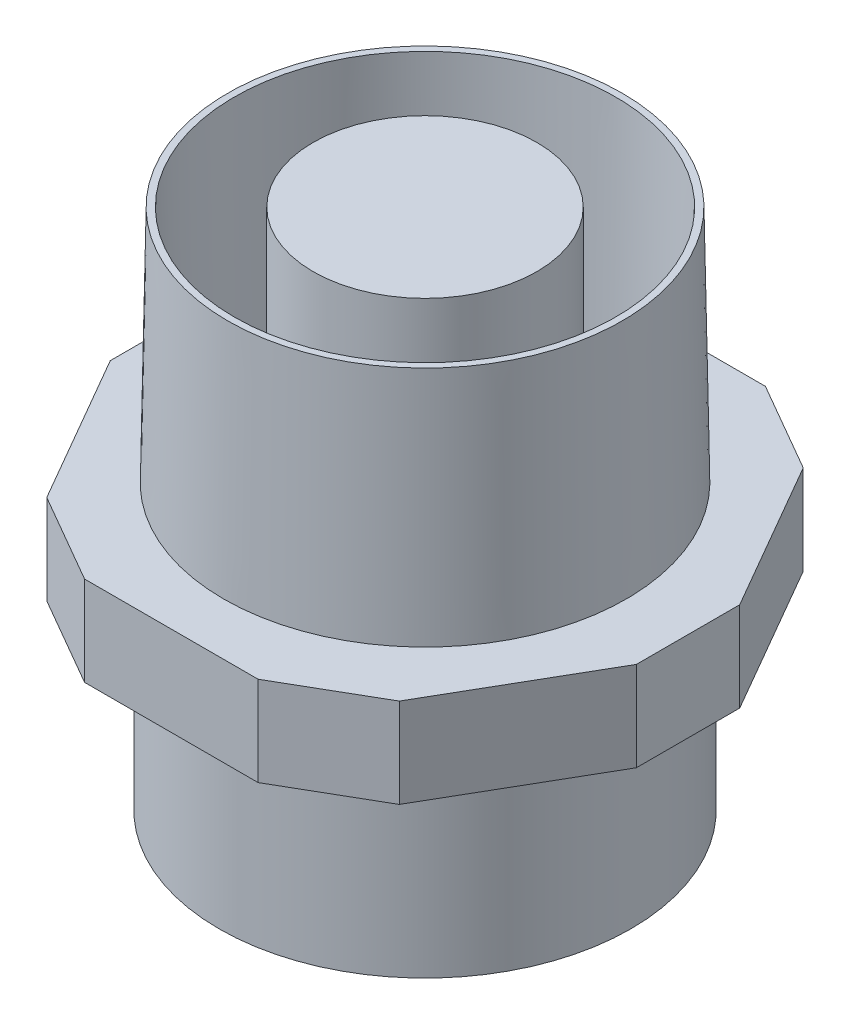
from build123d import *

# Parameters (mm, degrees)
EXTRUSION1_DEPTH = 3
ESQUISSE2_R      = 6.75
ESQUISSE2_R_2    = 6.25
EXTRUSION2_DEPTH = 8
EXTRUSION2_DRAFT = 1
ESQUISSE3_R      = 6.9
EXTRUSION3_DEPTH = 6.5
CHANFREIN1_SIZE  = 2
ESQUISSE4_R      = 3.75
EXTRUSION4_DEPTH = 8


with BuildPart() as part:
    # Esquisse1 → Extrusion1 (new body)
    with BuildSketch(Plane(origin=(0, 0, 0), x_dir=(1, 0, 0), z_dir=(0, 1, 0))):
        Polygon((9.814954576, 0), (4.907477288, 8.5), (-4.907477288, 8.5), (-9.814954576, 0), (-4.907477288, -8.5), (4.907477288, -8.5), align=None)
    extrude(amount=EXTRUSION1_DEPTH)


with BuildPart() as extrusion2_tool:
    # Esquisse2 → Extrusion2 (with draft: the straight prism first)
    with BuildSketch(Plane(origin=(0, 3, 0), x_dir=(1, 0, 0), z_dir=(0, 1, 0))):
        Circle(ESQUISSE2_R)
        Circle(ESQUISSE2_R_2, mode=Mode.SUBTRACT)
    extrude(amount=EXTRUSION2_DEPTH)
    # Extrusion2: the draft: its side faces are tilted about the plane it starts from
    extrusion2_sides = [extrusion2_tool.faces().sort_by_distance(p)[0] for p in [
        (-6.75, 7, 0),
        (-6.25, 7, 0),
    ]]
    draft(extrusion2_sides, Plane(origin=(0, 3, 0), x_dir=(1, 0, 0), z_dir=(0, 1, 0)), EXTRUSION2_DRAFT)


with BuildPart() as part_1:
    add(part.part)

    # Extrusion2: add extrusion2_tool
    add(extrusion2_tool.part)

    # Esquisse3 → Extrusion3 (add)
    with BuildSketch(Plane.XZ):
        with Locations(Location((0, 0, 0), (0, 0, 90))):
            Circle(ESQUISSE3_R)
    extrude(amount=EXTRUSION3_DEPTH)

    # Chanfrein1
    chanfrein1_edges = [part_1.edges().sort_by_distance(p)[0] for p in [
        (4.907477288, 1.5, 8.5),
        (-4.907477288, 1.5, 8.5),
        (-9.814954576, 1.5, 0),
        (-4.907477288, 1.5, -8.5),
        (4.907477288, 1.5, -8.5),
        (9.814954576, 1.5, 0),
    ]]
    chamfer(chanfrein1_edges, length=CHANFREIN1_SIZE)

    # Esquisse4 → Extrusion4 (add)
    with BuildSketch(Plane(origin=(0, 3, 0), x_dir=(1, 0, 0), z_dir=(0, 1, 0))):
        with Locations(Location((0, 0, 0), (0, 0, 270))):
            Circle(ESQUISSE4_R)
    extrude(amount=EXTRUSION4_DEPTH)


solid = part_1.part
